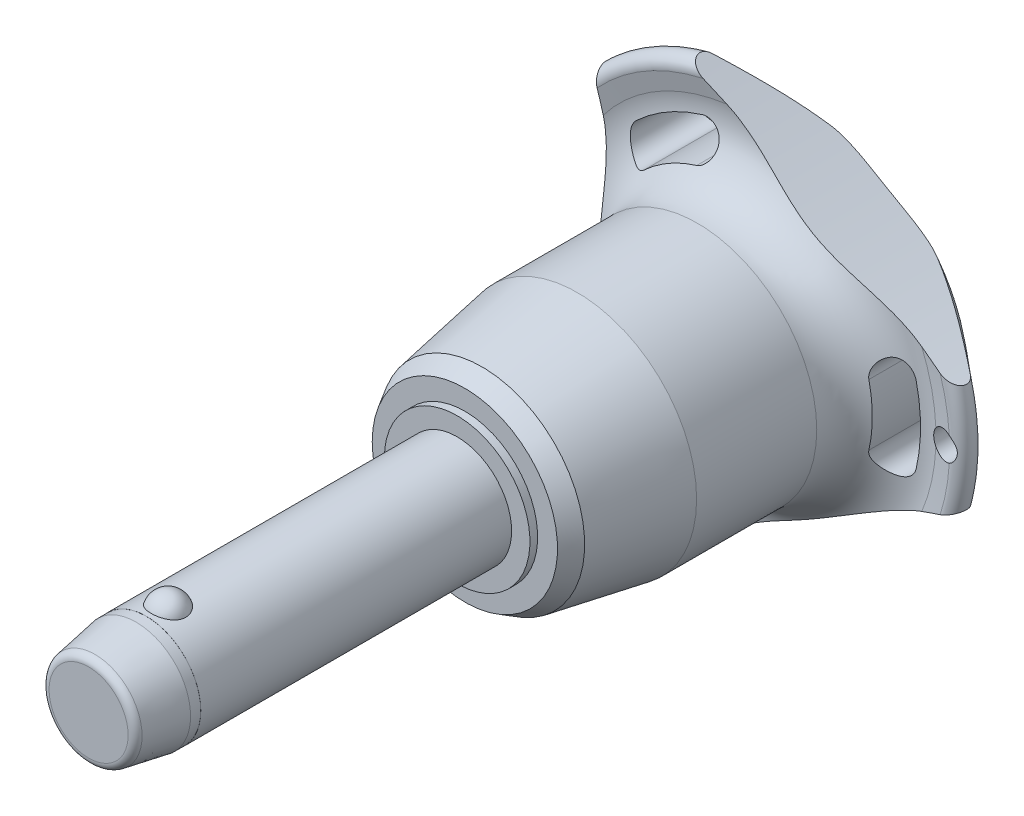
from build123d import *

# Parameters (mm, degrees)
SKETCH1_R           = 6
BOSS_EXTRUDE1_DEPTH = 30
SKETCH2_R           = 5.15
BOSS_EXTRUDE2_DEPTH = 39.7
BOSS_EXTRUDE3_START = 10.6
SKETCH1_2_R         = 6
BOSS_EXTRUDE3_DEPTH = 10.6
CHAMFER1_SIZE       = 5.3
CHAMFER1_SIZE2      = 0.934532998
FILLET1_R           = 0.85
SKETCH6_R           = 144.275
CUT_EXTRUDE1_DEPTH  = 78.404041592
CIRPATTERN1_COUNT   = 3
SKETCH7_R           = 1.5
CUT_EXTRUDE2_DEPTH  = 78.144330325
SKETCH8_R           = 6
SKETCH8_R_2         = 5.99
CUT_EXTRUDE3_DEPTH  = 6.36


with BuildPart() as part:
    # Sketch1 → Boss-Extrude1 (new body)
    with BuildSketch(Plane.XY):
        Circle(SKETCH1_R)
    extrude(amount=-BOSS_EXTRUDE1_DEPTH)

    # Sketch2 → Boss-Extrude2 (add)
    with BuildSketch(Plane(origin=(0, 0, -30), x_dir=(-1, 0, 0), z_dir=(0, 0, -1))):
        Circle(SKETCH2_R)
    extrude(amount=BOSS_EXTRUDE2_DEPTH)

    # Sketch3 → Revolve1 (revolve)
    with BuildSketch(Plane(origin=(0, 0, 0), x_dir=(0, 0, -1), z_dir=(1, 0, 0))):
        with BuildLine():
            Line((-1.854049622, 7.25), (-1.854049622, 3.25))
            ThreePointArc((-1.854049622, 3.25), (0.145950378, 5.25), (-1.854049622, 7.25))
        make_face()
        with BuildLine():
            Line((-1.854049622, -3.25), (-1.854049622, -7.25))
            ThreePointArc((-1.854049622, -7.25), (0.145950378, -5.25), (-1.854049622, -3.25))
        make_face()
    revolve(axis=Axis((0, -3.25, 1.854049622), (0, 1, 0)))

    # Sketch1_2 → Boss-Extrude3 (add)
    with BuildSketch(Plane.XY.offset(BOSS_EXTRUDE3_START)):
        Circle(SKETCH1_2_R)
    extrude(amount=-BOSS_EXTRUDE3_DEPTH)

    # Chamfer1
    chamfer1_edges = [part.edges().sort_by_distance(p)[0] for p in [
        (-6, 0, 10.6),
    ]]
    chamfer1_side = [part.faces().sort_by_distance(p)[0] for p in [
        (-6, 0, -9.7),
    ]]
    chamfer(chamfer1_edges, length=CHAMFER1_SIZE, length2=CHAMFER1_SIZE2, reference=chamfer1_side[0])

    # Fillet1
    fillet1_edges = [part.edges().sort_by_distance(p)[0] for p in [
        (-5.065467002, 0, 10.6),
        (5.15, 0, -69.7),
    ]]
    fillet(fillet1_edges, radius=FILLET1_R)

    # Sketch4 → Revolve2 (revolve)
    with BuildSketch(Plane(origin=(0, 0, 0), x_dir=(0, 0, -1), z_dir=(1, 0, 0)), mode=Mode.PRIVATE) as revolve2_sk:
        Polygon((30, 0), (30, 8.017240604), (30.85, 8.017240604), (30.85, 10.206249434), (32.745737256, 11.300753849), (43.233333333, 13.15), (56.466666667, 13.15), (56.466666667, 0), align=None)
    revolve(revolve2_sk.sketch.rotate(Axis((0, 0, -56.466666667), (0, 0, 1)), 90), axis=Axis((0, 0, -56.466666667), (0, 0, 1)))

    # Sketch5 → Revolve3 (revolve)
    with BuildSketch(Plane(origin=(0, 0, 0), x_dir=(0, 0, -1), z_dir=(1, 0, 0)), mode=Mode.PRIVATE) as revolve3_sk:
        with BuildLine():
            Line((62.32877039, 20.428960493), (61.910912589, 22.344207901))
            ThreePointArc((61.910912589, 22.344207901), (62.554394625, 23.677136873), (64.002586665, 23.371345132))
            Line((64.002586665, 23.371345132), (69.141488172, 17.247040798))
            ThreePointArc((69.141488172, 17.247040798), (69.7, 15.584758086), (68.978803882, 13.986322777))
            ThreePointArc((68.978803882, 13.986322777), (64.617427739, 7.589034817), (63.083333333, 0))
            Line((63.083333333, 0), (56.466666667, 0))
            Line((56.466666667, 0), (56.466666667, 13.15))
            ThreePointArc((56.466666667, 13.15), (61.139661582, 15.38660811), (62.32877039, 20.428960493))
        make_face()
    revolve(revolve3_sk.sketch.rotate(Axis((0, 0, -63.083333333), (0, 0, 1)), 90), axis=Axis((0, 0, -63.083333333), (0, 0, 1)))

    # Sketch6 → Cut-Extrude1 (cut, through all)
    with BuildSketch(Plane.XY):
        with Locations((-159.975, 0)):
            Circle(SKETCH6_R)
        with BuildLine():
            ThreePointArc((18.131206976, -4.190753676), (18.60922037, 0), (18.131206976, 4.190753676))
            ThreePointArc((18.131206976, 4.190753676), (15.94840906, 5.553949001), (14.585213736, 3.371151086))
            ThreePointArc((14.585213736, 3.371151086), (14.969740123, 0), (14.585213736, -3.371151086))
            ThreePointArc((14.585213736, -3.371151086), (15.94840906, -5.553949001), (18.131206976, -4.190753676))
        make_face()
    cut_extrude1 = extrude(amount=-CUT_EXTRUDE1_DEPTH, mode=Mode.SUBTRACT)

    # CirPattern1: Cut-Extrude1 ×3 about axis
    cirpattern1_axis = Axis((0, 0, 0), (0, 0, 1))
    for i in range(1, CIRPATTERN1_COUNT):
        add(cut_extrude1.rotate(cirpattern1_axis, i * 360 / CIRPATTERN1_COUNT), mode=Mode.SUBTRACT)

    # Sketch7 → Cut-Extrude2 (cut, through all)
    with BuildSketch(Plane.XY):
        with Locations(Location((21.60922037, 0, 0), (0, 0, 297.620773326))):
            Circle(SKETCH7_R)
    extrude(amount=-CUT_EXTRUDE2_DEPTH, mode=Mode.SUBTRACT)

    # Sketch8 → Cut-Extrude3 (cut)
    with BuildSketch(Plane.XY.offset(10.6)):
        Circle(SKETCH8_R)
        Circle(SKETCH8_R_2, mode=Mode.SUBTRACT)
    extrude(amount=-CUT_EXTRUDE3_DEPTH, mode=Mode.SUBTRACT)


solid = part.part
